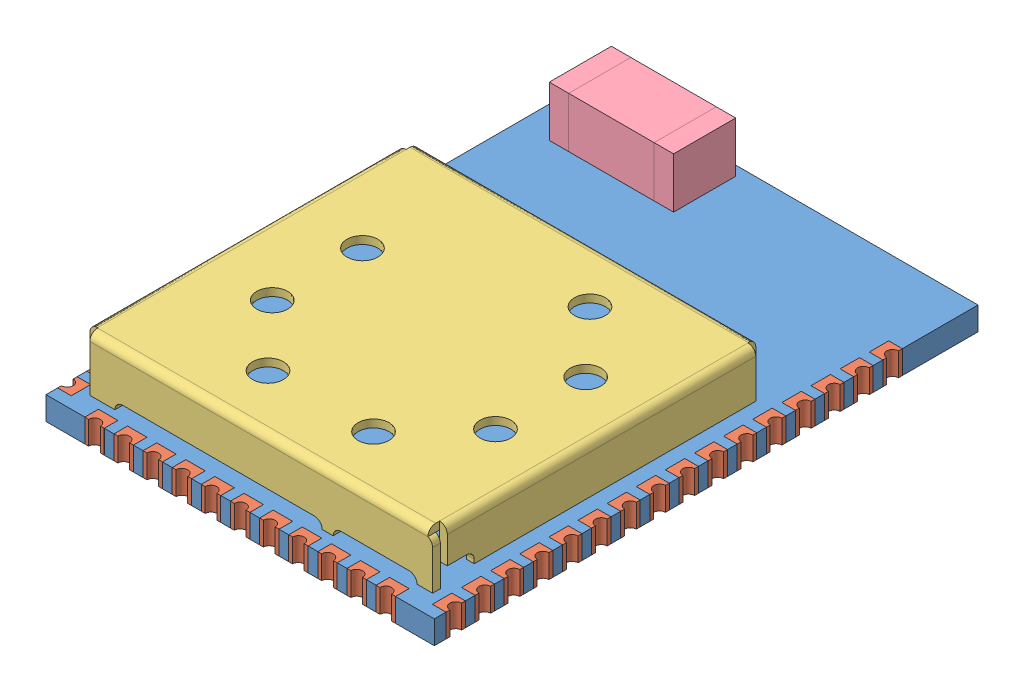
SolidWorks assembly BL652_SA_A1.SLDASM, configuration Default (file format 5000). Lengths in mm.
Overall size (10 2.1 14).
42 component instances, 4 part files, 16 mates.
Components (placement in the parent):
- BL652 A1 PCB-1: BL652 A1 PCB.SLDPRT [Default] at origin size (10 0.6 14)
- BL652 A1 Pad-1: BL652 A1 Pad.SLDPRT [Default] at (1 0 0) size (0.5 0.6 0.7)
- BL652 A1 Pad-2: BL652 A1 Pad.SLDPRT [Default] at (10 0 -0.3) x (0 0 -1) z (1 0 0) size (0.5 0.6 0.7)
- BL652 A1 Pad-3: BL652 A1 Pad.SLDPRT [Default] at (0 0 -9.05) x (0 0 1) z (-1 0 0) size (0.5 0.6 0.7)
- BL652 A1 Pad-4: BL652 A1 Pad.SLDPRT [Default] at (1.75 0 0) size (0.5 0.6 0.7)
- BL652 A1 Pad-5: BL652 A1 Pad.SLDPRT [Default] at (2.5 0 0) size (0.5 0.6 0.7)
- BL652 A1 Pad-6: BL652 A1 Pad.SLDPRT [Default] at (3.25 0 0) size (0.5 0.6 0.7)
- BL652 A1 Pad-7: BL652 A1 Pad.SLDPRT [Default] at (4 0 0) size (0.5 0.6 0.7)
- BL652 A1 Pad-8: BL652 A1 Pad.SLDPRT [Default] at (4.75 0 0) size (0.5 0.6 0.7)
- BL652 A1 Pad-9: BL652 A1 Pad.SLDPRT [Default] at (5.5 0 0) size (0.5 0.6 0.7)
- BL652 A1 Pad-10: BL652 A1 Pad.SLDPRT [Default] at (6.25 0 0) size (0.5 0.6 0.7)
- BL652 A1 Pad-11: BL652 A1 Pad.SLDPRT [Default] at (7 0 0) size (0.5 0.6 0.7)
- BL652 A1 Pad-12: BL652 A1 Pad.SLDPRT [Default] at (7.75 0 0) size (0.5 0.6 0.7)
- BL652 A1 Pad-13: BL652 A1 Pad.SLDPRT [Default] at (8.5 0 0) size (0.5 0.6 0.7)
- BL652 A1 Pad-14: BL652 A1 Pad.SLDPRT [Default] at (10 0 -1.05) x (0 0 -1) z (1 0 0) size (0.5 0.6 0.7)
- BL652 A1 Pad-15: BL652 A1 Pad.SLDPRT [Default] at (10 0 -1.8) x (0 0 -1) z (1 0 0) size (0.5 0.6 0.7)
- BL652 A1 Pad-16: BL652 A1 Pad.SLDPRT [Default] at (10 0 -2.55) x (0 0 -1) z (1 0 0) size (0.5 0.6 0.7)
- BL652 A1 Pad-17: BL652 A1 Pad.SLDPRT [Default] at (10 0 -3.3) x (0 0 -1) z (1 0 0) size (0.5 0.6 0.7)
- BL652 A1 Pad-18: BL652 A1 Pad.SLDPRT [Default] at (10 0 -4.05) x (0 0 -1) z (1 0 0) size (0.5 0.6 0.7)
- BL652 A1 Pad-19: BL652 A1 Pad.SLDPRT [Default] at (10 0 -4.8) x (0 0 -1) z (1 0 0) size (0.5 0.6 0.7)
- BL652 A1 Pad-20: BL652 A1 Pad.SLDPRT [Default] at (10 0 -5.55) x (0 0 -1) z (1 0 0) size (0.5 0.6 0.7)
- BL652 A1 Pad-21: BL652 A1 Pad.SLDPRT [Default] at (10 0 -6.3) x (0 0 -1) z (1 0 0) size (0.5 0.6 0.7)
- BL652 A1 Pad-22: BL652 A1 Pad.SLDPRT [Default] at (10 0 -7.05) x (0 0 -1) z (1 0 0) size (0.5 0.6 0.7)
- BL652 A1 Pad-23: BL652 A1 Pad.SLDPRT [Default] at (10 0 -7.8) x (0 0 -1) z (1 0 0) size (0.5 0.6 0.7)
- BL652 A1 Pad-24: BL652 A1 Pad.SLDPRT [Default] at (10 0 -8.55) x (0 0 -1) z (1 0 0) size (0.5 0.6 0.7)
- BL652 A1 Pad-25: BL652 A1 Pad.SLDPRT [Default] at (10 0 -9.3) x (0 0 -1) z (1 0 0) size (0.5 0.6 0.7)
- BL652 A1 Pad-26: BL652 A1 Pad.SLDPRT [Default] at (10 0 -10.05) x (0 0 -1) z (1 0 0) size (0.5 0.6 0.7)
- BL652 A1 Pad-27: BL652 A1 Pad.SLDPRT [Default] at (10 0 -10.8) x (0 0 -1) z (1 0 0) size (0.5 0.6 0.7)
- BL652 A1 Pad-28: BL652 A1 Pad.SLDPRT [Default] at (10 0 -11.55) x (0 0 -1) z (1 0 0) size (0.5 0.6 0.7)
- BL652 A1 Pad-29: BL652 A1 Pad.SLDPRT [Default] at (0 0 -8.3) x (0 0 1) z (-1 0 0) size (0.5 0.6 0.7)
- BL652 A1 Pad-30: BL652 A1 Pad.SLDPRT [Default] at (0 0 -7.55) x (0 0 1) z (-1 0 0) size (0.5 0.6 0.7)
- BL652 A1 Pad-31: BL652 A1 Pad.SLDPRT [Default] at (0 0 -6.8) x (0 0 1) z (-1 0 0) size (0.5 0.6 0.7)
- BL652 A1 Pad-32: BL652 A1 Pad.SLDPRT [Default] at (0 0 -6.05) x (0 0 1) z (-1 0 0) size (0.5 0.6 0.7)
- BL652 A1 Pad-33: BL652 A1 Pad.SLDPRT [Default] at (0 0 -5.3) x (0 0 1) z (-1 0 0) size (0.5 0.6 0.7)
- BL652 A1 Pad-34: BL652 A1 Pad.SLDPRT [Default] at (0 0 -4.55) x (0 0 1) z (-1 0 0) size (0.5 0.6 0.7)
- BL652 A1 Pad-35: BL652 A1 Pad.SLDPRT [Default] at (0 0 -3.8) x (0 0 1) z (-1 0 0) size (0.5 0.6 0.7)
- BL652 A1 Pad-36: BL652 A1 Pad.SLDPRT [Default] at (0 0 -3.05) x (0 0 1) z (-1 0 0) size (0.5 0.6 0.7)
- BL652 A1 Pad-37: BL652 A1 Pad.SLDPRT [Default] at (0 0 -2.3) x (0 0 1) z (-1 0 0) size (0.5 0.6 0.7)
- BL652 A1 Pad-38: BL652 A1 Pad.SLDPRT [Default] at (0 0 -1.55) x (0 0 1) z (-1 0 0) size (0.5 0.6 0.7)
- BL652 A1 Pad-39: BL652 A1 Pad.SLDPRT [Default] at (0 0 -0.8) x (0 0 1) z (-1 0 0) size (0.5 0.6 0.7)
- shielding_bl652_b0_20160622-1: shielding_bl652_b0_20160622.SLDPRT [Default] at (10.1217 0.7 0.04) x (0 0 -1) z (0 1 0) size (8.45 9.12 1.4)
- BL652 Antenna-1: BL652 Antenna.SLDPRT [Default] at (0.91 0.7 -12.05) size (3.2 1.3 1.6)
Mates (geometry in assembly coordinates):
- Coincident1: coincident anti-aligned: plane of BL652 A1 PCB-1 through (0 0 -0.7) normal (0 0 1); plane of BL652 A1 Pad-1 through (1 0.6 -0.7) normal (0 0 -1)
- Coincident2: coincident aligned: plane of BL652 A1 PCB-1 through (0 0.6 0) normal (0 1 0); plane of BL652 A1 Pad-1 through (1 0.6 0) normal (0 1 0)
- Coincident3: coincident anti-aligned: plane of BL652 A1 PCB-1 through (1 0 -0.7) normal (1 0 0); plane of BL652 A1 Pad-1 through (1 0.6 0) normal (-1 0 0)
- Coincident4: coincident anti-aligned: plane of BL652 A1 PCB-1 through (9.3 0 0) normal (1 0 0); plane of BL652 A1 Pad-2 through (9.3 0.6 -0.3) normal (-1 0 0)
- Coincident5: coincident aligned: plane of BL652 A1 PCB-1 through (0 0.6 0) normal (0 1 0); plane of BL652 A1 Pad-2 through (10 0.6 -0.3) normal (0 1 0)
- Coincident6: coincident anti-aligned: plane of BL652 A1 PCB-1 through (9.3 0 -0.3) normal (0 0 -1); plane of BL652 A1 Pad-2 through (10 0.6 -0.3) normal (0 0 1)
- Coincident7: coincident anti-aligned: plane of BL652 A1 PCB-1 through (0.7 0 0) normal (-1 0 0); plane of BL652 A1 Pad-3 through (0.7 0.6 -9.05) normal (1 0 0)
- Coincident8: coincident aligned: plane of BL652 A1 PCB-1 through (0 0.6 0) normal (0 1 0); plane of BL652 A1 Pad-3 through (0 0.6 -9.05) normal (0 1 0)
- Coincident9: coincident anti-aligned: plane of BL652 A1 PCB-1 through (0.7 0 -9.05) normal (0 0 1); plane of BL652 A1 Pad-3 through (0 0.6 -9.05) normal (0 0 -1)
- Distance1: distance = 0.1 mm: plane of shielding_bl652_b0_20160622-1 through (9.3052 0.7 -0.55) normal (0 -1 0); plane of BL652 A1 PCB-1 through (0 0.6 0) normal (0 1 0)
- Parallel1: parallel: plane of BL652 A1 PCB-1 through (0 0.6 0) normal (0 0 1); plane of shielding_bl652_b0_20160622-1 through (0.6681 2.1 -0.45) normal (0 0 1)
- Distance2: distance = 0.45 mm: plane of shielding_bl652_b0_20160622-1 through (0.6681 2.1 -0.45) normal (0 0 1); plane of BL652 A1 PCB-1 through (0 0.6 0) normal (0 0 1)
- Distance3: distance = 0.495 mm aligned: plane of shielding_bl652_b0_20160622-1 through (9.505 1.4 -0.55) normal (1 0 0); plane of BL652 A1 PCB-1 through (10 0.6 0) normal (1 0 0)
- Distance4: distance = 0.1 mm: plane of BL652 A1 PCB-1 through (0 0.6 0) normal (0 1 0); plane of BL652 Antenna-1 through (0.91 0.7 -12.05) normal (0 -1 0)
- Distance5: distance = 0.91 mm: plane of BL652 Antenna-1 through (0.91 2 -12.05) normal (-1 0 0); plane of BL652 A1 PCB-1 through (0 0.6 0) normal (-1 0 0)
- Distance6: distance = 0.35 mm aligned: plane of BL652 Antenna-1 through (0.91 2 -13.65) normal (0 0 -1); plane of BL652 A1 PCB-1 through (0 0.6 -14) normal (0 0 -1)
